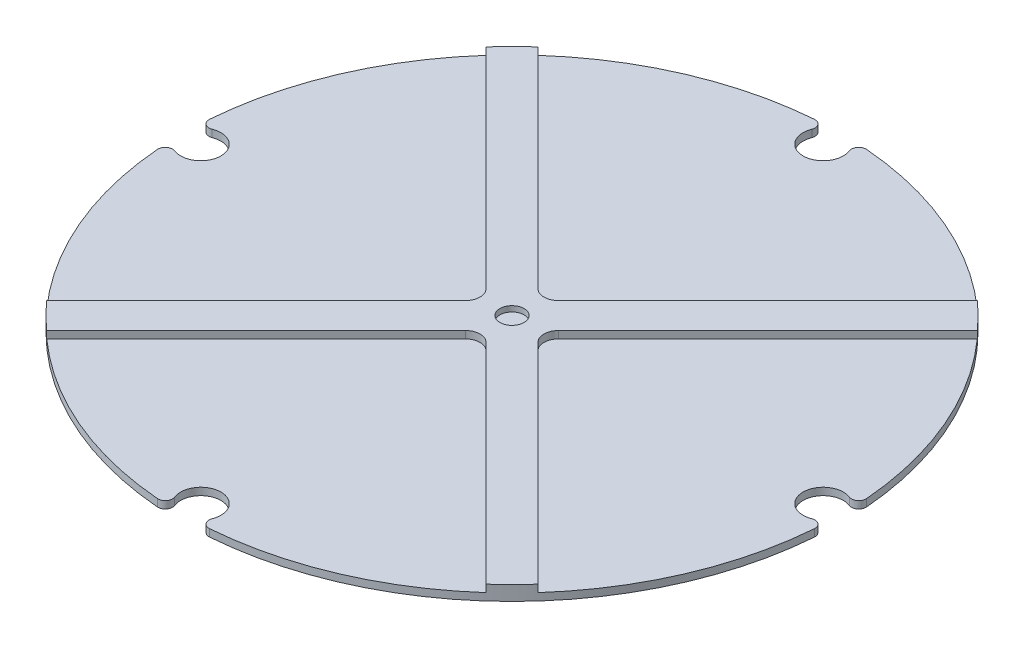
ISO-10303-21;
HEADER;
FILE_DESCRIPTION(('STEP AP214'),'2;1');
FILE_NAME('part.step','',(''),(''),'','','');
FILE_SCHEMA(('AUTOMOTIVE_DESIGN { 1 0 10303 214 1 1 1 1 }'));
ENDSEC;
DATA;
#1=APPLICATION_CONTEXT('core data for automotive mechanical design processes');
#2=APPLICATION_PROTOCOL_DEFINITION('international standard','automotive_design',2000,#1);
#3=PRODUCT_CONTEXT('',#1,'mechanical');
#4=PRODUCT('Part','Part','',(#3));
#5=PRODUCT_RELATED_PRODUCT_CATEGORY('part','',(#4));
#6=PRODUCT_DEFINITION_FORMATION('','',#4);
#7=PRODUCT_DEFINITION_CONTEXT('part definition',#1,'design');
#8=PRODUCT_DEFINITION('design','',#6,#7);
#9=PRODUCT_DEFINITION_SHAPE('','',#8);
#10=(LENGTH_UNIT() NAMED_UNIT(*) SI_UNIT(.MILLI.,.METRE.));
#11=(NAMED_UNIT(*) PLANE_ANGLE_UNIT() SI_UNIT($,.RADIAN.));
#12=(NAMED_UNIT(*) SI_UNIT($,.STERADIAN.) SOLID_ANGLE_UNIT());
#13=UNCERTAINTY_MEASURE_WITH_UNIT(LENGTH_MEASURE(1.E-05),#10,'distance_accuracy_value','');
#14=(GEOMETRIC_REPRESENTATION_CONTEXT(3) GLOBAL_UNCERTAINTY_ASSIGNED_CONTEXT((#13)) GLOBAL_UNIT_ASSIGNED_CONTEXT((#10,
#11,#12)) REPRESENTATION_CONTEXT('',''));
#15=CARTESIAN_POINT('',(0.,0.,0.));
#16=DIRECTION('',(0.,0.,1.));
#17=DIRECTION('',(1.,0.,0.));
#18=AXIS2_PLACEMENT_3D('',#15,#16,#17);
#19=CARTESIAN_POINT('',(0.,1.,0.));
#20=DIRECTION('',(0.,1.,0.));
#21=DIRECTION('',(0.,0.,1.));
#22=AXIS2_PLACEMENT_3D('',#19,#20,#21);
#23=PLANE('',#22);
#24=DIRECTION('',(0.707106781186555,0.,-0.70710678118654));
#25=VECTOR('',#24,1.);
#26=CARTESIAN_POINT('',(33.5384295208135,1.,-30.0028956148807));
#27=LINE('',#26,#25);
#28=CARTESIAN_POINT('',(4.94974746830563,1.,-1.4142135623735));
#29=VERTEX_POINT('',#28);
#30=CARTESIAN_POINT('',(33.5384295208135,1.,-30.0028956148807));
#31=VERTEX_POINT('',#30);
#32=EDGE_CURVE('E47',#29,#31,#27,.T.);
#33=ORIENTED_EDGE('',*,*,#32,.F.);
#34=CARTESIAN_POINT('',(6.3639610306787,1.,-3.7610192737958E-13));
#35=DIRECTION('',(0.,-1.,0.));
#36=DIRECTION('',(0.,0.,-1.));
#37=AXIS2_PLACEMENT_3D('',#34,#35,#36);
#38=CIRCLE('',#37,2.);
#39=CARTESIAN_POINT('',(4.94974746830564,1.,1.41421356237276));
#40=VERTEX_POINT('',#39);
#41=EDGE_CURVE('E51',#40,#29,#38,.T.);
#42=ORIENTED_EDGE('',*,*,#41,.F.);
#43=DIRECTION('',(-0.707106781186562,0.,-0.707106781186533));
#44=VECTOR('',#43,1.);
#45=CARTESIAN_POINT('',(4.94974746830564,1.,1.41421356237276));
#46=LINE('',#45,#44);
#47=CARTESIAN_POINT('',(33.5384295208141,1.,30.00289561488));
#48=VERTEX_POINT('',#47);
#49=EDGE_CURVE('E494',#48,#40,#46,.T.);
#50=ORIENTED_EDGE('',*,*,#49,.F.);
#51=CARTESIAN_POINT('',(0.,1.,0.));
#52=DIRECTION('',(0.,1.,0.));
#53=DIRECTION('',(0.,0.,1.));
#54=AXIS2_PLACEMENT_3D('',#51,#52,#53);
#55=CIRCLE('',#54,45.);
#56=CARTESIAN_POINT('',(44.8578709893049,1.,3.57371099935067));
#57=VERTEX_POINT('',#56);
#58=EDGE_CURVE('E288',#48,#57,#55,.T.);
#59=ORIENTED_EDGE('',*,*,#58,.T.);
#60=CARTESIAN_POINT('',(43.8610294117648,1.,3.49429519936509));
#61=DIRECTION('',(0.,1.,0.));
#62=DIRECTION('',(0.,0.,1.));
#63=AXIS2_PLACEMENT_3D('',#60,#61,#62);
#64=CIRCLE('',#63,1.);
#65=CARTESIAN_POINT('',(43.4980882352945,1.,2.56248314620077));
#66=VERTEX_POINT('',#65);
#67=EDGE_CURVE('E338',#57,#66,#64,.T.);
#68=ORIENTED_EDGE('',*,*,#67,.T.);
#69=CARTESIAN_POINT('',(42.5000000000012,1.,-1.20271790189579E-12));
#70=DIRECTION('',(0.,1.,0.));
#71=DIRECTION('',(0.,0.,1.));
#72=AXIS2_PLACEMENT_3D('',#69,#70,#71);
#73=CIRCLE('',#72,2.75);
#74=CARTESIAN_POINT('',(43.4980882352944,1.,-2.56248314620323));
#75=VERTEX_POINT('',#74);
#76=EDGE_CURVE('E273',#75,#66,#73,.T.);
#77=ORIENTED_EDGE('',*,*,#76,.F.);
#78=CARTESIAN_POINT('',(43.8610294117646,1.,-3.49429519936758));
#79=DIRECTION('',(0.,1.,0.));
#80=DIRECTION('',(0.,0.,1.));
#81=AXIS2_PLACEMENT_3D('',#78,#79,#80);
#82=CIRCLE('',#81,1.);
#83=CARTESIAN_POINT('',(44.8578709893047,1.,-3.5737109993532));
#84=VERTEX_POINT('',#83);
#85=EDGE_CURVE('E336',#75,#84,#82,.T.);
#86=ORIENTED_EDGE('',*,*,#85,.T.);
#87=EDGE_CURVE('E516',#84,#31,#55,.T.);
#88=ORIENTED_EDGE('',*,*,#87,.T.);
#89=EDGE_LOOP('',(#33,#42,#50,#59,#68,#77,#86,#88));
#90=FACE_BOUND('',#89,.T.);
#91=ADVANCED_FACE('F32',(#90),#23,.T.);
#92=DIRECTION('',(0.70710678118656,0.,0.707106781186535));
#93=VECTOR('',#92,1.);
#94=CARTESIAN_POINT('',(1.41421356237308,1.,4.94974746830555));
#95=LINE('',#94,#93);
#96=CARTESIAN_POINT('',(1.41421356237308,1.,4.94974746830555));
#97=VERTEX_POINT('',#96);
#98=CARTESIAN_POINT('',(30.0028956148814,1.,33.5384295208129));
#99=VERTEX_POINT('',#98);
#100=EDGE_CURVE('E492',#97,#99,#95,.T.);
#101=ORIENTED_EDGE('',*,*,#100,.F.);
#102=CARTESIAN_POINT('',(0.,1.,6.36396103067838));
#103=DIRECTION('',(0.,-1.,0.));
#104=DIRECTION('',(0.,0.,1.));
#105=AXIS2_PLACEMENT_3D('',#102,#103,#104);
#106=CIRCLE('',#105,1.9999999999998);
#107=CARTESIAN_POINT('',(-1.41421356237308,1.,4.94974746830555));
#108=VERTEX_POINT('',#107);
#109=EDGE_CURVE('E489',#108,#97,#106,.T.);
#110=ORIENTED_EDGE('',*,*,#109,.F.);
#111=DIRECTION('',(0.707106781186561,0.,-0.707106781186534));
#112=VECTOR('',#111,1.);
#113=CARTESIAN_POINT('',(-1.41421356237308,1.,4.94974746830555));
#114=LINE('',#113,#112);
#115=CARTESIAN_POINT('',(-30.0028956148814,1.,33.5384295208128));
#116=VERTEX_POINT('',#115);
#117=EDGE_CURVE('E486',#116,#108,#114,.T.);
#118=ORIENTED_EDGE('',*,*,#117,.F.);
#119=CARTESIAN_POINT('',(-3.57371099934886,1.,44.857870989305));
#120=VERTEX_POINT('',#119);
#121=EDGE_CURVE('E287',#116,#120,#55,.T.);
#122=ORIENTED_EDGE('',*,*,#121,.T.);
#123=CARTESIAN_POINT('',(-3.49429519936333,1.,43.8610294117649));
#124=DIRECTION('',(0.,1.,0.));
#125=DIRECTION('',(0.,0.,1.));
#126=AXIS2_PLACEMENT_3D('',#123,#124,#125);
#127=CIRCLE('',#126,1.);
#128=CARTESIAN_POINT('',(-2.56248314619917,1.,43.4980882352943));
#129=VERTEX_POINT('',#128);
#130=EDGE_CURVE('E342',#120,#129,#127,.T.);
#131=ORIENTED_EDGE('',*,*,#130,.T.);
#132=CARTESIAN_POINT('',(2.40543580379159E-12,1.,42.5));
#133=DIRECTION('',(0.,1.,0.));
#134=DIRECTION('',(0.,0.,1.));
#135=AXIS2_PLACEMENT_3D('',#132,#133,#134);
#136=CIRCLE('',#135,2.75);
#137=CARTESIAN_POINT('',(2.5624831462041,1.,43.498088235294));
#138=VERTEX_POINT('',#137);
#139=EDGE_CURVE('E267',#138,#129,#136,.T.);
#140=ORIENTED_EDGE('',*,*,#139,.F.);
#141=CARTESIAN_POINT('',(3.49429519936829,1.,43.8610294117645));
#142=DIRECTION('',(0.,1.,0.));
#143=DIRECTION('',(0.,0.,1.));
#144=AXIS2_PLACEMENT_3D('',#141,#142,#143);
#145=CIRCLE('',#144,1.);
#146=CARTESIAN_POINT('',(3.57371099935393,1.,44.8578709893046));
#147=VERTEX_POINT('',#146);
#148=EDGE_CURVE('E340',#138,#147,#145,.T.);
#149=ORIENTED_EDGE('',*,*,#148,.T.);
#150=EDGE_CURVE('E285',#147,#99,#55,.T.);
#151=ORIENTED_EDGE('',*,*,#150,.T.);
#152=EDGE_LOOP('',(#101,#110,#118,#122,#131,#140,#149,#151));
#153=FACE_BOUND('',#152,.T.);
#154=ADVANCED_FACE('F404',(#153),#23,.T.);
#155=DIRECTION('',(-0.707106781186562,0.,0.707106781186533));
#156=VECTOR('',#155,1.);
#157=CARTESIAN_POINT('',(-4.94974746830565,1.,1.41421356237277));
#158=LINE('',#157,#156);
#159=CARTESIAN_POINT('',(-4.94974746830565,1.,1.41421356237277));
#160=VERTEX_POINT('',#159);
#161=CARTESIAN_POINT('',(-33.5384295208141,1.,30.00289561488));
#162=VERTEX_POINT('',#161);
#163=EDGE_CURVE('E483',#160,#162,#158,.T.);
#164=ORIENTED_EDGE('',*,*,#163,.F.);
#165=CARTESIAN_POINT('',(-6.3639610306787,1.,-3.68316488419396E-13));
#166=DIRECTION('',(0.,-1.,0.));
#167=DIRECTION('',(0.,0.,-1.));
#168=AXIS2_PLACEMENT_3D('',#165,#166,#167);
#169=CIRCLE('',#168,1.99999999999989);
#170=CARTESIAN_POINT('',(-4.94974746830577,1.,-1.41421356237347));
#171=VERTEX_POINT('',#170);
#172=EDGE_CURVE('E480',#171,#160,#169,.T.);
#173=ORIENTED_EDGE('',*,*,#172,.F.);
#174=DIRECTION('',(0.707106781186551,0.,0.707106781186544));
#175=VECTOR('',#174,1.);
#176=CARTESIAN_POINT('',(-33.5384295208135,1.,-30.0028956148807));
#177=LINE('',#176,#175);
#178=CARTESIAN_POINT('',(-33.5384295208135,1.,-30.0028956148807));
#179=VERTEX_POINT('',#178);
#180=EDGE_CURVE('E472',#179,#171,#177,.T.);
#181=ORIENTED_EDGE('',*,*,#180,.F.);
#182=CARTESIAN_POINT('',(-44.857870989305,1.,-3.57371099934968));
#183=VERTEX_POINT('',#182);
#184=EDGE_CURVE('E289',#179,#183,#55,.T.);
#185=ORIENTED_EDGE('',*,*,#184,.T.);
#186=CARTESIAN_POINT('',(-43.8610294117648,1.,-3.49429519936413));
#187=DIRECTION('',(0.,1.,0.));
#188=DIRECTION('',(0.,0.,1.));
#189=AXIS2_PLACEMENT_3D('',#186,#187,#188);
#190=CIRCLE('',#189,1.);
#191=CARTESIAN_POINT('',(-43.4980882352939,1.,-2.56248314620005));
#192=VERTEX_POINT('',#191);
#193=EDGE_CURVE('E344',#183,#192,#190,.T.);
#194=ORIENTED_EDGE('',*,*,#193,.T.);
#195=CARTESIAN_POINT('',(-42.4999999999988,1.,1.20792265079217E-12));
#196=DIRECTION('',(0.,1.,0.));
#197=DIRECTION('',(0.,0.,1.));
#198=AXIS2_PLACEMENT_3D('',#195,#196,#197);
#199=CIRCLE('',#198,2.75);
#200=CARTESIAN_POINT('',(-43.4980882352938,1.,2.56248314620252));
#201=VERTEX_POINT('',#200);
#202=EDGE_CURVE('E264',#201,#192,#199,.T.);
#203=ORIENTED_EDGE('',*,*,#202,.F.);
#204=CARTESIAN_POINT('',(-43.8610294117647,1.,3.49429519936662));
#205=DIRECTION('',(0.,1.,0.));
#206=DIRECTION('',(0.,0.,1.));
#207=AXIS2_PLACEMENT_3D('',#204,#205,#206);
#208=CIRCLE('',#207,1.);
#209=CARTESIAN_POINT('',(-44.8578709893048,1.,3.57371099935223));
#210=VERTEX_POINT('',#209);
#211=EDGE_CURVE('E346',#201,#210,#208,.T.);
#212=ORIENTED_EDGE('',*,*,#211,.T.);
#213=EDGE_CURVE('E290',#210,#162,#55,.T.);
#214=ORIENTED_EDGE('',*,*,#213,.T.);
#215=EDGE_LOOP('',(#164,#173,#181,#185,#194,#203,#212,#214));
#216=FACE_BOUND('',#215,.T.);
#217=ADVANCED_FACE('F520',(#216),#23,.T.);
#218=CARTESIAN_POINT('',(0.,1.,0.));
#219=DIRECTION('',(0.,-1.,0.));
#220=DIRECTION('',(0.,0.,-1.));
#221=AXIS2_PLACEMENT_3D('',#218,#219,#220);
#222=CYLINDRICAL_SURFACE('',#221,45.);
#223=ORIENTED_EDGE('',*,*,#150,.F.);
#224=DIRECTION('',(0.,-1.,0.));
#225=VECTOR('',#224,1.);
#226=CARTESIAN_POINT('',(3.57371099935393,1.,44.8578709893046));
#227=LINE('',#226,#225);
#228=CARTESIAN_POINT('',(3.57371099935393,0.,44.8578709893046));
#229=VERTEX_POINT('',#228);
#230=EDGE_CURVE('E361',#147,#229,#227,.T.);
#231=ORIENTED_EDGE('',*,*,#230,.T.);
#232=CARTESIAN_POINT('',(0.,0.,0.));
#233=DIRECTION('',(0.,1.,0.));
#234=DIRECTION('',(0.,0.,1.));
#235=AXIS2_PLACEMENT_3D('',#232,#233,#234);
#236=CIRCLE('',#235,45.);
#237=CARTESIAN_POINT('',(44.8578709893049,0.,3.57371099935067));
#238=VERTEX_POINT('',#237);
#239=EDGE_CURVE('E295',#229,#238,#236,.T.);
#240=ORIENTED_EDGE('',*,*,#239,.T.);
#241=DIRECTION('',(0.,-1.,0.));
#242=VECTOR('',#241,1.);
#243=CARTESIAN_POINT('',(44.8578709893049,1.,3.57371099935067));
#244=LINE('',#243,#242);
#245=EDGE_CURVE('E358',#238,#57,#244,.F.);
#246=ORIENTED_EDGE('',*,*,#245,.T.);
#247=ORIENTED_EDGE('',*,*,#58,.F.);
#248=DIRECTION('',(0.,-1.,0.));
#249=VECTOR('',#248,1.);
#250=CARTESIAN_POINT('',(33.5384295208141,2.,30.00289561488));
#251=LINE('',#250,#249);
#252=CARTESIAN_POINT('',(33.5384295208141,2.,30.00289561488));
#253=VERTEX_POINT('',#252);
#254=EDGE_CURVE('E427',#253,#48,#251,.T.);
#255=ORIENTED_EDGE('',*,*,#254,.F.);
#256=CARTESIAN_POINT('',(0.,2.,0.));
#257=DIRECTION('',(0.,1.,0.));
#258=DIRECTION('',(0.,0.,1.));
#259=AXIS2_PLACEMENT_3D('',#256,#257,#258);
#260=CIRCLE('',#259,45.);
#261=CARTESIAN_POINT('',(30.0028956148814,2.,33.5384295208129));
#262=VERTEX_POINT('',#261);
#263=EDGE_CURVE('E423',#262,#253,#260,.T.);
#264=ORIENTED_EDGE('',*,*,#263,.F.);
#265=DIRECTION('',(0.,-1.,0.));
#266=VECTOR('',#265,1.);
#267=CARTESIAN_POINT('',(30.0028956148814,2.,33.5384295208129));
#268=LINE('',#267,#266);
#269=EDGE_CURVE('E421',#262,#99,#268,.T.);
#270=ORIENTED_EDGE('',*,*,#269,.T.);
#271=EDGE_LOOP('',(#223,#231,#240,#246,#247,#255,#264,#270));
#272=FACE_BOUND('',#271,.T.);
#273=ADVANCED_FACE('F417',(#272),#222,.T.);
#274=ORIENTED_EDGE('',*,*,#213,.F.);
#275=DIRECTION('',(0.,-1.,0.));
#276=VECTOR('',#275,1.);
#277=CARTESIAN_POINT('',(-44.8578709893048,1.,3.57371099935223));
#278=LINE('',#277,#276);
#279=CARTESIAN_POINT('',(-44.8578709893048,0.,3.57371099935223));
#280=VERTEX_POINT('',#279);
#281=EDGE_CURVE('E309',#210,#280,#278,.T.);
#282=ORIENTED_EDGE('',*,*,#281,.T.);
#283=CARTESIAN_POINT('',(-3.57371099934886,0.,44.857870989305));
#284=VERTEX_POINT('',#283);
#285=EDGE_CURVE('E294',#280,#284,#236,.T.);
#286=ORIENTED_EDGE('',*,*,#285,.T.);
#287=DIRECTION('',(0.,-1.,0.));
#288=VECTOR('',#287,1.);
#289=CARTESIAN_POINT('',(-3.57371099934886,1.,44.857870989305));
#290=LINE('',#289,#288);
#291=EDGE_CURVE('E306',#284,#120,#290,.F.);
#292=ORIENTED_EDGE('',*,*,#291,.T.);
#293=ORIENTED_EDGE('',*,*,#121,.F.);
#294=DIRECTION('',(0.,-1.,0.));
#295=VECTOR('',#294,1.);
#296=CARTESIAN_POINT('',(-30.0028956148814,2.,33.5384295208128));
#297=LINE('',#296,#295);
#298=CARTESIAN_POINT('',(-30.0028956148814,2.,33.5384295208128));
#299=VERTEX_POINT('',#298);
#300=EDGE_CURVE('E439',#299,#116,#297,.T.);
#301=ORIENTED_EDGE('',*,*,#300,.F.);
#302=CARTESIAN_POINT('',(0.,2.,0.));
#303=DIRECTION('',(0.,1.,0.));
#304=DIRECTION('',(0.,0.,1.));
#305=AXIS2_PLACEMENT_3D('',#302,#303,#304);
#306=CIRCLE('',#305,45.);
#307=CARTESIAN_POINT('',(-33.5384295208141,2.,30.00289561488));
#308=VERTEX_POINT('',#307);
#309=EDGE_CURVE('E530',#308,#299,#306,.T.);
#310=ORIENTED_EDGE('',*,*,#309,.F.);
#311=DIRECTION('',(0.,-1.,0.));
#312=VECTOR('',#311,1.);
#313=CARTESIAN_POINT('',(-33.5384295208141,2.,30.00289561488));
#314=LINE('',#313,#312);
#315=EDGE_CURVE('E442',#308,#162,#314,.T.);
#316=ORIENTED_EDGE('',*,*,#315,.T.);
#317=EDGE_LOOP('',(#274,#282,#286,#292,#293,#301,#310,#316));
#318=FACE_BOUND('',#317,.T.);
#319=ADVANCED_FACE('F394',(#318),#222,.T.);
#320=CARTESIAN_POINT('',(-3.5737109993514,0.,-44.8578709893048));
#321=VERTEX_POINT('',#320);
#322=CARTESIAN_POINT('',(-44.857870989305,0.,-3.57371099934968));
#323=VERTEX_POINT('',#322);
#324=EDGE_CURVE('E291',#321,#323,#236,.T.);
#325=ORIENTED_EDGE('',*,*,#324,.T.);
#326=DIRECTION('',(0.,-1.,0.));
#327=VECTOR('',#326,1.);
#328=CARTESIAN_POINT('',(-44.857870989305,1.,-3.57371099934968));
#329=LINE('',#328,#327);
#330=EDGE_CURVE('E351',#323,#183,#329,.F.);
#331=ORIENTED_EDGE('',*,*,#330,.T.);
#332=ORIENTED_EDGE('',*,*,#184,.F.);
#333=DIRECTION('',(0.,-1.,0.));
#334=VECTOR('',#333,1.);
#335=CARTESIAN_POINT('',(-33.5384295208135,2.,-30.0028956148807));
#336=LINE('',#335,#334);
#337=CARTESIAN_POINT('',(-33.5384295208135,2.,-30.0028956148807));
#338=VERTEX_POINT('',#337);
#339=EDGE_CURVE('E451',#338,#179,#336,.T.);
#340=ORIENTED_EDGE('',*,*,#339,.F.);
#341=CARTESIAN_POINT('',(0.,2.,0.));
#342=DIRECTION('',(0.,1.,0.));
#343=DIRECTION('',(0.,0.,1.));
#344=AXIS2_PLACEMENT_3D('',#341,#342,#343);
#345=CIRCLE('',#344,45.);
#346=CARTESIAN_POINT('',(-30.0028956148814,2.,-33.5384295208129));
#347=VERTEX_POINT('',#346);
#348=EDGE_CURVE('E886',#347,#338,#345,.T.);
#349=ORIENTED_EDGE('',*,*,#348,.F.);
#350=DIRECTION('',(0.,-1.,0.));
#351=VECTOR('',#350,1.);
#352=CARTESIAN_POINT('',(-30.0028956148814,2.,-33.5384295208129));
#353=LINE('',#352,#351);
#354=CARTESIAN_POINT('',(-30.0028956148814,1.,-33.5384295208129));
#355=VERTEX_POINT('',#354);
#356=EDGE_CURVE('E454',#347,#355,#353,.T.);
#357=ORIENTED_EDGE('',*,*,#356,.T.);
#358=CARTESIAN_POINT('',(-3.5737109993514,1.,-44.8578709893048));
#359=VERTEX_POINT('',#358);
#360=EDGE_CURVE('E300',#359,#355,#55,.T.);
#361=ORIENTED_EDGE('',*,*,#360,.F.);
#362=DIRECTION('',(0.,-1.,0.));
#363=VECTOR('',#362,1.);
#364=CARTESIAN_POINT('',(-3.5737109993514,1.,-44.8578709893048));
#365=LINE('',#364,#363);
#366=EDGE_CURVE('E348',#359,#321,#365,.T.);
#367=ORIENTED_EDGE('',*,*,#366,.T.);
#368=EDGE_LOOP('',(#325,#331,#332,#340,#349,#357,#361,#367));
#369=FACE_BOUND('',#368,.T.);
#370=ADVANCED_FACE('F582',(#369),#222,.T.);
#371=ORIENTED_EDGE('',*,*,#87,.F.);
#372=DIRECTION('',(0.,-1.,0.));
#373=VECTOR('',#372,1.);
#374=CARTESIAN_POINT('',(44.8578709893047,1.,-3.5737109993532));
#375=LINE('',#374,#373);
#376=CARTESIAN_POINT('',(44.8578709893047,0.,-3.5737109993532));
#377=VERTEX_POINT('',#376);
#378=EDGE_CURVE('E370',#84,#377,#375,.T.);
#379=ORIENTED_EDGE('',*,*,#378,.T.);
#380=CARTESIAN_POINT('',(3.5737109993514,0.,-44.8578709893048));
#381=VERTEX_POINT('',#380);
#382=EDGE_CURVE('E284',#377,#381,#236,.T.);
#383=ORIENTED_EDGE('',*,*,#382,.T.);
#384=DIRECTION('',(0.,-1.,0.));
#385=VECTOR('',#384,1.);
#386=CARTESIAN_POINT('',(3.5737109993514,1.,-44.8578709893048));
#387=LINE('',#386,#385);
#388=CARTESIAN_POINT('',(3.5737109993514,1.,-44.8578709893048));
#389=VERTEX_POINT('',#388);
#390=EDGE_CURVE('E368',#381,#389,#387,.F.);
#391=ORIENTED_EDGE('',*,*,#390,.T.);
#392=CARTESIAN_POINT('',(30.0028956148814,1.,-33.5384295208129));
#393=VERTEX_POINT('',#392);
#394=EDGE_CURVE('E263',#393,#389,#55,.T.);
#395=ORIENTED_EDGE('',*,*,#394,.F.);
#396=DIRECTION('',(0.,-1.,0.));
#397=VECTOR('',#396,1.);
#398=CARTESIAN_POINT('',(30.0028956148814,2.,-33.5384295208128));
#399=LINE('',#398,#397);
#400=CARTESIAN_POINT('',(30.0028956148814,2.,-33.5384295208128));
#401=VERTEX_POINT('',#400);
#402=EDGE_CURVE('E243',#401,#393,#399,.T.);
#403=ORIENTED_EDGE('',*,*,#402,.F.);
#404=CARTESIAN_POINT('',(0.,2.,0.));
#405=DIRECTION('',(0.,1.,0.));
#406=DIRECTION('',(0.,0.,1.));
#407=AXIS2_PLACEMENT_3D('',#404,#405,#406);
#408=CIRCLE('',#407,45.);
#409=CARTESIAN_POINT('',(33.5384295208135,2.,-30.0028956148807));
#410=VERTEX_POINT('',#409);
#411=EDGE_CURVE('E249',#410,#401,#408,.T.);
#412=ORIENTED_EDGE('',*,*,#411,.F.);
#413=DIRECTION('',(0.,-1.,0.));
#414=VECTOR('',#413,1.);
#415=CARTESIAN_POINT('',(33.5384295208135,2.,-30.0028956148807));
#416=LINE('',#415,#414);
#417=EDGE_CURVE('E498',#410,#31,#416,.T.);
#418=ORIENTED_EDGE('',*,*,#417,.T.);
#419=EDGE_LOOP('',(#371,#379,#383,#391,#395,#403,#412,#418));
#420=FACE_BOUND('',#419,.T.);
#421=ADVANCED_FACE('F261',(#420),#222,.T.);
#422=DIRECTION('',(-0.707106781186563,0.,-0.707106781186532));
#423=VECTOR('',#422,1.);
#424=CARTESIAN_POINT('',(-30.0028956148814,1.,-33.5384295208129));
#425=LINE('',#424,#423);
#426=CARTESIAN_POINT('',(-1.41421356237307,1.,-4.9497474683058));
#427=VERTEX_POINT('',#426);
#428=EDGE_CURVE('E463',#427,#355,#425,.T.);
#429=ORIENTED_EDGE('',*,*,#428,.F.);
#430=CARTESIAN_POINT('',(0.,1.,-6.36396103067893));
#431=DIRECTION('',(0.,-1.,0.));
#432=DIRECTION('',(0.,0.,1.));
#433=AXIS2_PLACEMENT_3D('',#430,#431,#432);
#434=CIRCLE('',#433,2.0000000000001);
#435=CARTESIAN_POINT('',(1.41421356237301,1.,-4.94974746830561));
#436=VERTEX_POINT('',#435);
#437=EDGE_CURVE('E468',#436,#427,#434,.T.);
#438=ORIENTED_EDGE('',*,*,#437,.F.);
#439=DIRECTION('',(-0.70710678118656,0.,0.707106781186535));
#440=VECTOR('',#439,1.);
#441=CARTESIAN_POINT('',(30.0028956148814,1.,-33.5384295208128));
#442=LINE('',#441,#440);
#443=EDGE_CURVE('E470',#393,#436,#442,.T.);
#444=ORIENTED_EDGE('',*,*,#443,.F.);
#445=ORIENTED_EDGE('',*,*,#394,.T.);
#446=CARTESIAN_POINT('',(3.49429519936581,1.,-43.8610294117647));
#447=DIRECTION('',(0.,1.,0.));
#448=DIRECTION('',(0.,0.,1.));
#449=AXIS2_PLACEMENT_3D('',#446,#447,#448);
#450=CIRCLE('',#449,1.);
#451=CARTESIAN_POINT('',(2.56248314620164,1.,-43.4980882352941));
#452=VERTEX_POINT('',#451);
#453=EDGE_CURVE('E332',#389,#452,#450,.T.);
#454=ORIENTED_EDGE('',*,*,#453,.T.);
#455=CARTESIAN_POINT('',(0.,1.,-42.5));
#456=DIRECTION('',(0.,1.,0.));
#457=DIRECTION('',(0.,0.,1.));
#458=AXIS2_PLACEMENT_3D('',#455,#456,#457);
#459=CIRCLE('',#458,2.75);
#460=CARTESIAN_POINT('',(-2.56248314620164,1.,-43.4980882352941));
#461=VERTEX_POINT('',#460);
#462=EDGE_CURVE('E276',#461,#452,#459,.T.);
#463=ORIENTED_EDGE('',*,*,#462,.F.);
#464=CARTESIAN_POINT('',(-3.49429519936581,1.,-43.8610294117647));
#465=DIRECTION('',(0.,1.,0.));
#466=DIRECTION('',(0.,0.,1.));
#467=AXIS2_PLACEMENT_3D('',#464,#465,#466);
#468=CIRCLE('',#467,1.);
#469=EDGE_CURVE('E334',#461,#359,#468,.T.);
#470=ORIENTED_EDGE('',*,*,#469,.T.);
#471=ORIENTED_EDGE('',*,*,#360,.T.);
#472=EDGE_LOOP('',(#429,#438,#444,#445,#454,#463,#470,#471));
#473=FACE_BOUND('',#472,.T.);
#474=ADVANCED_FACE('F571',(#473),#23,.T.);
#475=CARTESIAN_POINT('',(0.,0.,0.));
#476=DIRECTION('',(0.,1.,0.));
#477=DIRECTION('',(0.,0.,1.));
#478=AXIS2_PLACEMENT_3D('',#475,#476,#477);
#479=PLANE('',#478);
#480=ORIENTED_EDGE('',*,*,#285,.F.);
#481=CARTESIAN_POINT('',(-43.8610294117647,0.,3.49429519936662));
#482=DIRECTION('',(0.,1.,0.));
#483=DIRECTION('',(0.,0.,1.));
#484=AXIS2_PLACEMENT_3D('',#481,#482,#483);
#485=CIRCLE('',#484,1.);
#486=CARTESIAN_POINT('',(-43.4980882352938,0.,2.56248314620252));
#487=VERTEX_POINT('',#486);
#488=EDGE_CURVE('E326',#280,#487,#485,.F.);
#489=ORIENTED_EDGE('',*,*,#488,.T.);
#490=CARTESIAN_POINT('',(-42.4999999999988,0.,1.20792265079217E-12));
#491=DIRECTION('',(0.,1.,0.));
#492=DIRECTION('',(0.,0.,1.));
#493=AXIS2_PLACEMENT_3D('',#490,#491,#492);
#494=CIRCLE('',#493,2.75);
#495=CARTESIAN_POINT('',(-43.4980882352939,0.,-2.56248314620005));
#496=VERTEX_POINT('',#495);
#497=EDGE_CURVE('E299',#487,#496,#494,.T.);
#498=ORIENTED_EDGE('',*,*,#497,.T.);
#499=CARTESIAN_POINT('',(-43.8610294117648,0.,-3.49429519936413));
#500=DIRECTION('',(0.,1.,0.));
#501=DIRECTION('',(0.,0.,1.));
#502=AXIS2_PLACEMENT_3D('',#499,#500,#501);
#503=CIRCLE('',#502,1.);
#504=EDGE_CURVE('E324',#496,#323,#503,.F.);
#505=ORIENTED_EDGE('',*,*,#504,.T.);
#506=ORIENTED_EDGE('',*,*,#324,.F.);
#507=CARTESIAN_POINT('',(-3.49429519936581,0.,-43.8610294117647));
#508=DIRECTION('',(0.,1.,0.));
#509=DIRECTION('',(0.,0.,1.));
#510=AXIS2_PLACEMENT_3D('',#507,#508,#509);
#511=CIRCLE('',#510,1.);
#512=CARTESIAN_POINT('',(-2.56248314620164,0.,-43.4980882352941));
#513=VERTEX_POINT('',#512);
#514=EDGE_CURVE('E314',#321,#513,#511,.F.);
#515=ORIENTED_EDGE('',*,*,#514,.T.);
#516=CARTESIAN_POINT('',(0.,0.,-42.5));
#517=DIRECTION('',(0.,1.,0.));
#518=DIRECTION('',(0.,0.,1.));
#519=AXIS2_PLACEMENT_3D('',#516,#517,#518);
#520=CIRCLE('',#519,2.75);
#521=CARTESIAN_POINT('',(2.56248314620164,0.,-43.4980882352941));
#522=VERTEX_POINT('',#521);
#523=EDGE_CURVE('E296',#513,#522,#520,.T.);
#524=ORIENTED_EDGE('',*,*,#523,.T.);
#525=CARTESIAN_POINT('',(3.49429519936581,0.,-43.8610294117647));
#526=DIRECTION('',(0.,1.,0.));
#527=DIRECTION('',(0.,0.,1.));
#528=AXIS2_PLACEMENT_3D('',#525,#526,#527);
#529=CIRCLE('',#528,1.);
#530=EDGE_CURVE('E312',#522,#381,#529,.F.);
#531=ORIENTED_EDGE('',*,*,#530,.T.);
#532=ORIENTED_EDGE('',*,*,#382,.F.);
#533=CARTESIAN_POINT('',(43.8610294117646,0.,-3.49429519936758));
#534=DIRECTION('',(0.,1.,0.));
#535=DIRECTION('',(0.,0.,1.));
#536=AXIS2_PLACEMENT_3D('',#533,#534,#535);
#537=CIRCLE('',#536,1.);
#538=CARTESIAN_POINT('',(43.4980882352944,0.,-2.56248314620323));
#539=VERTEX_POINT('',#538);
#540=EDGE_CURVE('E316',#377,#539,#537,.F.);
#541=ORIENTED_EDGE('',*,*,#540,.T.);
#542=CARTESIAN_POINT('',(42.5000000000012,0.,-1.20271790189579E-12));
#543=DIRECTION('',(0.,1.,0.));
#544=DIRECTION('',(0.,0.,1.));
#545=AXIS2_PLACEMENT_3D('',#542,#543,#544);
#546=CIRCLE('',#545,2.75);
#547=CARTESIAN_POINT('',(43.4980882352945,0.,2.56248314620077));
#548=VERTEX_POINT('',#547);
#549=EDGE_CURVE('E303',#539,#548,#546,.T.);
#550=ORIENTED_EDGE('',*,*,#549,.T.);
#551=CARTESIAN_POINT('',(43.8610294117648,0.,3.49429519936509));
#552=DIRECTION('',(0.,1.,0.));
#553=DIRECTION('',(0.,0.,1.));
#554=AXIS2_PLACEMENT_3D('',#551,#552,#553);
#555=CIRCLE('',#554,1.);
#556=EDGE_CURVE('E318',#548,#238,#555,.F.);
#557=ORIENTED_EDGE('',*,*,#556,.T.);
#558=ORIENTED_EDGE('',*,*,#239,.F.);
#559=CARTESIAN_POINT('',(3.49429519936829,0.,43.8610294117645));
#560=DIRECTION('',(0.,1.,0.));
#561=DIRECTION('',(0.,0.,1.));
#562=AXIS2_PLACEMENT_3D('',#559,#560,#561);
#563=CIRCLE('',#562,1.);
#564=CARTESIAN_POINT('',(2.5624831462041,0.,43.498088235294));
#565=VERTEX_POINT('',#564);
#566=EDGE_CURVE('E320',#229,#565,#563,.F.);
#567=ORIENTED_EDGE('',*,*,#566,.T.);
#568=CARTESIAN_POINT('',(2.40543580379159E-12,0.,42.5));
#569=DIRECTION('',(0.,1.,0.));
#570=DIRECTION('',(0.,0.,1.));
#571=AXIS2_PLACEMENT_3D('',#568,#569,#570);
#572=CIRCLE('',#571,2.75);
#573=CARTESIAN_POINT('',(-2.56248314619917,0.,43.4980882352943));
#574=VERTEX_POINT('',#573);
#575=EDGE_CURVE('E277',#565,#574,#572,.T.);
#576=ORIENTED_EDGE('',*,*,#575,.T.);
#577=CARTESIAN_POINT('',(-3.49429519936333,0.,43.8610294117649));
#578=DIRECTION('',(0.,1.,0.));
#579=DIRECTION('',(0.,0.,1.));
#580=AXIS2_PLACEMENT_3D('',#577,#578,#579);
#581=CIRCLE('',#580,1.);
#582=EDGE_CURVE('E322',#574,#284,#581,.F.);
#583=ORIENTED_EDGE('',*,*,#582,.T.);
#584=EDGE_LOOP('',(#480,#489,#498,#505,#506,#515,#524,#531,#532,#541,#550,#557,#558,#567,#576,#583));
#585=FACE_BOUND('',#584,.T.);
#586=ADVANCED_FACE('F383',(#585),#479,.F.);
#587=CARTESIAN_POINT('',(0.,0.,-42.5));
#588=DIRECTION('',(0.,1.,0.));
#589=DIRECTION('',(0.,0.,1.));
#590=AXIS2_PLACEMENT_3D('',#587,#588,#589);
#591=CYLINDRICAL_SURFACE('',#590,2.75);
#592=ORIENTED_EDGE('',*,*,#523,.F.);
#593=DIRECTION('',(0.,1.,0.));
#594=VECTOR('',#593,1.);
#595=CARTESIAN_POINT('',(-2.56248314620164,0.,-43.4980882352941));
#596=LINE('',#595,#594);
#597=EDGE_CURVE('E11',#513,#461,#596,.T.);
#598=ORIENTED_EDGE('',*,*,#597,.T.);
#599=ORIENTED_EDGE('',*,*,#462,.T.);
#600=DIRECTION('',(0.,1.,0.));
#601=VECTOR('',#600,1.);
#602=CARTESIAN_POINT('',(2.56248314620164,0.,-43.4980882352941));
#603=LINE('',#602,#601);
#604=EDGE_CURVE('E40',#452,#522,#603,.F.);
#605=ORIENTED_EDGE('',*,*,#604,.T.);
#606=EDGE_LOOP('',(#592,#598,#599,#605));
#607=FACE_BOUND('',#606,.T.);
#608=ADVANCED_FACE('F375',(#607),#591,.F.);
#609=CARTESIAN_POINT('',(-42.4999999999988,0.,1.20792265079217E-12));
#610=DIRECTION('',(0.,1.,0.));
#611=DIRECTION('',(0.,0.,1.));
#612=AXIS2_PLACEMENT_3D('',#609,#610,#611);
#613=CYLINDRICAL_SURFACE('',#612,2.75);
#614=ORIENTED_EDGE('',*,*,#497,.F.);
#615=DIRECTION('',(0.,1.,0.));
#616=VECTOR('',#615,1.);
#617=CARTESIAN_POINT('',(-43.4980882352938,0.,2.56248314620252));
#618=LINE('',#617,#616);
#619=EDGE_CURVE('E330',#487,#201,#618,.T.);
#620=ORIENTED_EDGE('',*,*,#619,.T.);
#621=ORIENTED_EDGE('',*,*,#202,.T.);
#622=DIRECTION('',(0.,1.,0.));
#623=VECTOR('',#622,1.);
#624=CARTESIAN_POINT('',(-43.4980882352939,0.,-2.56248314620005));
#625=LINE('',#624,#623);
#626=EDGE_CURVE('E328',#192,#496,#625,.F.);
#627=ORIENTED_EDGE('',*,*,#626,.T.);
#628=EDGE_LOOP('',(#614,#620,#621,#627));
#629=FACE_BOUND('',#628,.T.);
#630=ADVANCED_FACE('F825',(#629),#613,.F.);
#631=CARTESIAN_POINT('',(2.40543580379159E-12,0.,42.5));
#632=DIRECTION('',(0.,1.,0.));
#633=DIRECTION('',(0.,0.,1.));
#634=AXIS2_PLACEMENT_3D('',#631,#632,#633);
#635=CYLINDRICAL_SURFACE('',#634,2.75);
#636=ORIENTED_EDGE('',*,*,#139,.T.);
#637=DIRECTION('',(0.,1.,0.));
#638=VECTOR('',#637,1.);
#639=CARTESIAN_POINT('',(-2.56248314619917,0.,43.4980882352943));
#640=LINE('',#639,#638);
#641=EDGE_CURVE('E356',#129,#574,#640,.F.);
#642=ORIENTED_EDGE('',*,*,#641,.T.);
#643=ORIENTED_EDGE('',*,*,#575,.F.);
#644=DIRECTION('',(0.,1.,0.));
#645=VECTOR('',#644,1.);
#646=CARTESIAN_POINT('',(2.5624831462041,0.,43.498088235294));
#647=LINE('',#646,#645);
#648=EDGE_CURVE('E354',#565,#138,#647,.T.);
#649=ORIENTED_EDGE('',*,*,#648,.T.);
#650=EDGE_LOOP('',(#636,#642,#643,#649));
#651=FACE_BOUND('',#650,.T.);
#652=ADVANCED_FACE('F407',(#651),#635,.F.);
#653=CARTESIAN_POINT('',(42.5000000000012,0.,-1.20271790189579E-12));
#654=DIRECTION('',(0.,1.,0.));
#655=DIRECTION('',(0.,0.,1.));
#656=AXIS2_PLACEMENT_3D('',#653,#654,#655);
#657=CYLINDRICAL_SURFACE('',#656,2.75);
#658=ORIENTED_EDGE('',*,*,#76,.T.);
#659=DIRECTION('',(0.,1.,0.));
#660=VECTOR('',#659,1.);
#661=CARTESIAN_POINT('',(43.4980882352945,0.,2.56248314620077));
#662=LINE('',#661,#660);
#663=EDGE_CURVE('E366',#66,#548,#662,.F.);
#664=ORIENTED_EDGE('',*,*,#663,.T.);
#665=ORIENTED_EDGE('',*,*,#549,.F.);
#666=DIRECTION('',(0.,1.,0.));
#667=VECTOR('',#666,1.);
#668=CARTESIAN_POINT('',(43.4980882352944,0.,-2.56248314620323));
#669=LINE('',#668,#667);
#670=EDGE_CURVE('E364',#539,#75,#669,.T.);
#671=ORIENTED_EDGE('',*,*,#670,.T.);
#672=EDGE_LOOP('',(#658,#664,#665,#671));
#673=FACE_BOUND('',#672,.T.);
#674=ADVANCED_FACE('F555',(#673),#657,.F.);
#675=CARTESIAN_POINT('',(-43.8610294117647,0.,3.49429519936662));
#676=DIRECTION('',(0.,1.,0.));
#677=DIRECTION('',(0.,0.,1.));
#678=AXIS2_PLACEMENT_3D('',#675,#676,#677);
#679=CYLINDRICAL_SURFACE('',#678,1.);
#680=ORIENTED_EDGE('',*,*,#211,.F.);
#681=ORIENTED_EDGE('',*,*,#619,.F.);
#682=ORIENTED_EDGE('',*,*,#488,.F.);
#683=ORIENTED_EDGE('',*,*,#281,.F.);
#684=EDGE_LOOP('',(#680,#681,#682,#683));
#685=FACE_BOUND('',#684,.T.);
#686=ADVANCED_FACE('F592',(#685),#679,.T.);
#687=CARTESIAN_POINT('',(-43.8610294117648,0.,-3.49429519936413));
#688=DIRECTION('',(0.,-1.,0.));
#689=DIRECTION('',(0.,0.,-1.));
#690=AXIS2_PLACEMENT_3D('',#687,#688,#689);
#691=CYLINDRICAL_SURFACE('',#690,1.);
#692=ORIENTED_EDGE('',*,*,#504,.F.);
#693=ORIENTED_EDGE('',*,*,#626,.F.);
#694=ORIENTED_EDGE('',*,*,#193,.F.);
#695=ORIENTED_EDGE('',*,*,#330,.F.);
#696=EDGE_LOOP('',(#692,#693,#694,#695));
#697=FACE_BOUND('',#696,.T.);
#698=ADVANCED_FACE('F595',(#697),#691,.T.);
#699=CARTESIAN_POINT('',(-3.49429519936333,0.,43.8610294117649));
#700=DIRECTION('',(0.,-1.,0.));
#701=DIRECTION('',(0.,0.,-1.));
#702=AXIS2_PLACEMENT_3D('',#699,#700,#701);
#703=CYLINDRICAL_SURFACE('',#702,1.);
#704=ORIENTED_EDGE('',*,*,#582,.F.);
#705=ORIENTED_EDGE('',*,*,#641,.F.);
#706=ORIENTED_EDGE('',*,*,#130,.F.);
#707=ORIENTED_EDGE('',*,*,#291,.F.);
#708=EDGE_LOOP('',(#704,#705,#706,#707));
#709=FACE_BOUND('',#708,.T.);
#710=ADVANCED_FACE('F400',(#709),#703,.T.);
#711=CARTESIAN_POINT('',(3.49429519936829,0.,43.8610294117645));
#712=DIRECTION('',(0.,1.,0.));
#713=DIRECTION('',(0.,0.,1.));
#714=AXIS2_PLACEMENT_3D('',#711,#712,#713);
#715=CYLINDRICAL_SURFACE('',#714,1.);
#716=ORIENTED_EDGE('',*,*,#148,.F.);
#717=ORIENTED_EDGE('',*,*,#648,.F.);
#718=ORIENTED_EDGE('',*,*,#566,.F.);
#719=ORIENTED_EDGE('',*,*,#230,.F.);
#720=EDGE_LOOP('',(#716,#717,#718,#719));
#721=FACE_BOUND('',#720,.T.);
#722=ADVANCED_FACE('F411',(#721),#715,.T.);
#723=CARTESIAN_POINT('',(43.8610294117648,0.,3.49429519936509));
#724=DIRECTION('',(0.,-1.,0.));
#725=DIRECTION('',(0.,0.,-1.));
#726=AXIS2_PLACEMENT_3D('',#723,#724,#725);
#727=CYLINDRICAL_SURFACE('',#726,1.);
#728=ORIENTED_EDGE('',*,*,#556,.F.);
#729=ORIENTED_EDGE('',*,*,#663,.F.);
#730=ORIENTED_EDGE('',*,*,#67,.F.);
#731=ORIENTED_EDGE('',*,*,#245,.F.);
#732=EDGE_LOOP('',(#728,#729,#730,#731));
#733=FACE_BOUND('',#732,.T.);
#734=ADVANCED_FACE('F559',(#733),#727,.T.);
#735=CARTESIAN_POINT('',(43.8610294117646,0.,-3.49429519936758));
#736=DIRECTION('',(0.,1.,0.));
#737=DIRECTION('',(0.,0.,1.));
#738=AXIS2_PLACEMENT_3D('',#735,#736,#737);
#739=CYLINDRICAL_SURFACE('',#738,1.);
#740=ORIENTED_EDGE('',*,*,#85,.F.);
#741=ORIENTED_EDGE('',*,*,#670,.F.);
#742=ORIENTED_EDGE('',*,*,#540,.F.);
#743=ORIENTED_EDGE('',*,*,#378,.F.);
#744=EDGE_LOOP('',(#740,#741,#742,#743));
#745=FACE_BOUND('',#744,.T.);
#746=ADVANCED_FACE('F550',(#745),#739,.T.);
#747=CARTESIAN_POINT('',(-3.49429519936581,0.,-43.8610294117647));
#748=DIRECTION('',(0.,1.,0.));
#749=DIRECTION('',(0.,0.,1.));
#750=AXIS2_PLACEMENT_3D('',#747,#748,#749);
#751=CYLINDRICAL_SURFACE('',#750,1.);
#752=ORIENTED_EDGE('',*,*,#469,.F.);
#753=ORIENTED_EDGE('',*,*,#597,.F.);
#754=ORIENTED_EDGE('',*,*,#514,.F.);
#755=ORIENTED_EDGE('',*,*,#366,.F.);
#756=EDGE_LOOP('',(#752,#753,#754,#755));
#757=FACE_BOUND('',#756,.T.);
#758=ADVANCED_FACE('F566',(#757),#751,.T.);
#759=CARTESIAN_POINT('',(3.49429519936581,0.,-43.8610294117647));
#760=DIRECTION('',(0.,-1.,0.));
#761=DIRECTION('',(0.,0.,-1.));
#762=AXIS2_PLACEMENT_3D('',#759,#760,#761);
#763=CYLINDRICAL_SURFACE('',#762,1.);
#764=ORIENTED_EDGE('',*,*,#530,.F.);
#765=ORIENTED_EDGE('',*,*,#604,.F.);
#766=ORIENTED_EDGE('',*,*,#453,.F.);
#767=ORIENTED_EDGE('',*,*,#390,.F.);
#768=EDGE_LOOP('',(#764,#765,#766,#767));
#769=FACE_BOUND('',#768,.T.);
#770=ADVANCED_FACE('F34',(#769),#763,.T.);
#771=CARTESIAN_POINT('',(30.0028956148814,2.,-33.5384295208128));
#772=DIRECTION('',(0.707106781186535,0.,0.70710678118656));
#773=DIRECTION('',(0.70710678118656,0.,-0.707106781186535));
#774=AXIS2_PLACEMENT_3D('',#771,#772,#773);
#775=PLANE('',#774);
#776=ORIENTED_EDGE('',*,*,#443,.T.);
#777=DIRECTION('',(0.,-1.,0.));
#778=VECTOR('',#777,1.);
#779=CARTESIAN_POINT('',(1.41421356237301,2.,-4.94974746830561));
#780=LINE('',#779,#778);
#781=CARTESIAN_POINT('',(1.41421356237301,2.,-4.94974746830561));
#782=VERTEX_POINT('',#781);
#783=EDGE_CURVE('E245',#782,#436,#780,.T.);
#784=ORIENTED_EDGE('',*,*,#783,.F.);
#785=DIRECTION('',(-0.70710678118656,0.,0.707106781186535));
#786=VECTOR('',#785,1.);
#787=CARTESIAN_POINT('',(30.0028956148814,2.,-33.5384295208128));
#788=LINE('',#787,#786);
#789=EDGE_CURVE('E238',#401,#782,#788,.T.);
#790=ORIENTED_EDGE('',*,*,#789,.F.);
#791=ORIENTED_EDGE('',*,*,#402,.T.);
#792=EDGE_LOOP('',(#776,#784,#790,#791));
#793=FACE_BOUND('',#792,.T.);
#794=ADVANCED_FACE('F241',(#793),#775,.F.);
#795=CARTESIAN_POINT('',(0.,2.,-6.36396103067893));
#796=DIRECTION('',(0.,-1.,0.));
#797=DIRECTION('',(0.,0.,-1.));
#798=AXIS2_PLACEMENT_3D('',#795,#796,#797);
#799=CYLINDRICAL_SURFACE('',#798,2.0000000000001);
#800=ORIENTED_EDGE('',*,*,#437,.T.);
#801=DIRECTION('',(0.,-1.,0.));
#802=VECTOR('',#801,1.);
#803=CARTESIAN_POINT('',(-1.41421356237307,2.,-4.9497474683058));
#804=LINE('',#803,#802);
#805=CARTESIAN_POINT('',(-1.41421356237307,2.,-4.9497474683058));
#806=VERTEX_POINT('',#805);
#807=EDGE_CURVE('E269',#806,#427,#804,.T.);
#808=ORIENTED_EDGE('',*,*,#807,.F.);
#809=CARTESIAN_POINT('',(0.,2.,-6.36396103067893));
#810=DIRECTION('',(0.,-1.,0.));
#811=DIRECTION('',(0.,0.,1.));
#812=AXIS2_PLACEMENT_3D('',#809,#810,#811);
#813=CIRCLE('',#812,2.0000000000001);
#814=EDGE_CURVE('E248',#782,#806,#813,.T.);
#815=ORIENTED_EDGE('',*,*,#814,.F.);
#816=ORIENTED_EDGE('',*,*,#783,.T.);
#817=EDGE_LOOP('',(#800,#808,#815,#816));
#818=FACE_BOUND('',#817,.T.);
#819=ADVANCED_FACE('F467',(#818),#799,.F.);
#820=CARTESIAN_POINT('',(-30.0028956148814,2.,-33.5384295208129));
#821=DIRECTION('',(-0.707106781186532,0.,0.707106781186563));
#822=DIRECTION('',(0.707106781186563,0.,0.707106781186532));
#823=AXIS2_PLACEMENT_3D('',#820,#821,#822);
#824=PLANE('',#823);
#825=ORIENTED_EDGE('',*,*,#428,.T.);
#826=ORIENTED_EDGE('',*,*,#356,.F.);
#827=DIRECTION('',(-0.707106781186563,0.,-0.707106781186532));
#828=VECTOR('',#827,1.);
#829=CARTESIAN_POINT('',(-30.0028956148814,2.,-33.5384295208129));
#830=LINE('',#829,#828);
#831=EDGE_CURVE('E464',#806,#347,#830,.T.);
#832=ORIENTED_EDGE('',*,*,#831,.F.);
#833=ORIENTED_EDGE('',*,*,#807,.T.);
#834=EDGE_LOOP('',(#825,#826,#832,#833));
#835=FACE_BOUND('',#834,.T.);
#836=ADVANCED_FACE('F461',(#835),#824,.F.);
#837=CARTESIAN_POINT('',(-33.5384295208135,2.,-30.0028956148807));
#838=DIRECTION('',(0.707106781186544,0.,-0.707106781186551));
#839=DIRECTION('',(-0.707106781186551,0.,-0.707106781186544));
#840=AXIS2_PLACEMENT_3D('',#837,#838,#839);
#841=PLANE('',#840);
#842=ORIENTED_EDGE('',*,*,#180,.T.);
#843=DIRECTION('',(0.,-1.,0.));
#844=VECTOR('',#843,1.);
#845=CARTESIAN_POINT('',(-4.94974746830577,2.,-1.41421356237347));
#846=LINE('',#845,#844);
#847=CARTESIAN_POINT('',(-4.94974746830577,2.,-1.41421356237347));
#848=VERTEX_POINT('',#847);
#849=EDGE_CURVE('E448',#848,#171,#846,.T.);
#850=ORIENTED_EDGE('',*,*,#849,.F.);
#851=DIRECTION('',(0.707106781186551,0.,0.707106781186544));
#852=VECTOR('',#851,1.);
#853=CARTESIAN_POINT('',(-33.5384295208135,2.,-30.0028956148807));
#854=LINE('',#853,#852);
#855=EDGE_CURVE('E888',#338,#848,#854,.T.);
#856=ORIENTED_EDGE('',*,*,#855,.F.);
#857=ORIENTED_EDGE('',*,*,#339,.T.);
#858=EDGE_LOOP('',(#842,#850,#856,#857));
#859=FACE_BOUND('',#858,.T.);
#860=ADVANCED_FACE('F706',(#859),#841,.F.);
#861=CARTESIAN_POINT('',(-6.3639610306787,2.,-3.68316488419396E-13));
#862=DIRECTION('',(0.,-1.,0.));
#863=DIRECTION('',(0.,0.,-1.));
#864=AXIS2_PLACEMENT_3D('',#861,#862,#863);
#865=CYLINDRICAL_SURFACE('',#864,1.99999999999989);
#866=ORIENTED_EDGE('',*,*,#172,.T.);
#867=DIRECTION('',(0.,-1.,0.));
#868=VECTOR('',#867,1.);
#869=CARTESIAN_POINT('',(-4.94974746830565,2.,1.41421356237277));
#870=LINE('',#869,#868);
#871=CARTESIAN_POINT('',(-4.94974746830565,2.,1.41421356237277));
#872=VERTEX_POINT('',#871);
#873=EDGE_CURVE('E445',#872,#160,#870,.T.);
#874=ORIENTED_EDGE('',*,*,#873,.F.);
#875=CARTESIAN_POINT('',(-6.3639610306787,2.,-3.68316488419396E-13));
#876=DIRECTION('',(0.,-1.,0.));
#877=DIRECTION('',(0.,0.,-1.));
#878=AXIS2_PLACEMENT_3D('',#875,#876,#877);
#879=CIRCLE('',#878,1.99999999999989);
#880=EDGE_CURVE('E537',#848,#872,#879,.T.);
#881=ORIENTED_EDGE('',*,*,#880,.F.);
#882=ORIENTED_EDGE('',*,*,#849,.T.);
#883=EDGE_LOOP('',(#866,#874,#881,#882));
#884=FACE_BOUND('',#883,.T.);
#885=ADVANCED_FACE('F715',(#884),#865,.F.);
#886=CARTESIAN_POINT('',(-4.94974746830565,2.,1.41421356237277));
#887=DIRECTION('',(0.707106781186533,0.,0.707106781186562));
#888=DIRECTION('',(0.707106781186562,0.,-0.707106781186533));
#889=AXIS2_PLACEMENT_3D('',#886,#887,#888);
#890=PLANE('',#889);
#891=ORIENTED_EDGE('',*,*,#163,.T.);
#892=ORIENTED_EDGE('',*,*,#315,.F.);
#893=DIRECTION('',(-0.707106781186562,0.,0.707106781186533));
#894=VECTOR('',#893,1.);
#895=CARTESIAN_POINT('',(-4.94974746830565,2.,1.41421356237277));
#896=LINE('',#895,#894);
#897=EDGE_CURVE('E533',#872,#308,#896,.T.);
#898=ORIENTED_EDGE('',*,*,#897,.F.);
#899=ORIENTED_EDGE('',*,*,#873,.T.);
#900=EDGE_LOOP('',(#891,#892,#898,#899));
#901=FACE_BOUND('',#900,.T.);
#902=ADVANCED_FACE('F525',(#901),#890,.F.);
#903=CARTESIAN_POINT('',(-1.41421356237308,2.,4.94974746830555));
#904=DIRECTION('',(-0.707106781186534,0.,-0.707106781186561));
#905=DIRECTION('',(-0.707106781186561,0.,0.707106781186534));
#906=AXIS2_PLACEMENT_3D('',#903,#904,#905);
#907=PLANE('',#906);
#908=ORIENTED_EDGE('',*,*,#117,.T.);
#909=DIRECTION('',(0.,-1.,0.));
#910=VECTOR('',#909,1.);
#911=CARTESIAN_POINT('',(-1.41421356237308,2.,4.94974746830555));
#912=LINE('',#911,#910);
#913=CARTESIAN_POINT('',(-1.41421356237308,2.,4.94974746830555));
#914=VERTEX_POINT('',#913);
#915=EDGE_CURVE('E430',#914,#108,#912,.T.);
#916=ORIENTED_EDGE('',*,*,#915,.F.);
#917=DIRECTION('',(0.707106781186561,0.,-0.707106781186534));
#918=VECTOR('',#917,1.);
#919=CARTESIAN_POINT('',(-1.41421356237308,2.,4.94974746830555));
#920=LINE('',#919,#918);
#921=EDGE_CURVE('E532',#299,#914,#920,.T.);
#922=ORIENTED_EDGE('',*,*,#921,.F.);
#923=ORIENTED_EDGE('',*,*,#300,.T.);
#924=EDGE_LOOP('',(#908,#916,#922,#923));
#925=FACE_BOUND('',#924,.T.);
#926=ADVANCED_FACE('F734',(#925),#907,.F.);
#927=CARTESIAN_POINT('',(0.,2.,6.36396103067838));
#928=DIRECTION('',(0.,-1.,0.));
#929=DIRECTION('',(0.,0.,-1.));
#930=AXIS2_PLACEMENT_3D('',#927,#928,#929);
#931=CYLINDRICAL_SURFACE('',#930,1.9999999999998);
#932=ORIENTED_EDGE('',*,*,#109,.T.);
#933=DIRECTION('',(0.,-1.,0.));
#934=VECTOR('',#933,1.);
#935=CARTESIAN_POINT('',(1.41421356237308,2.,4.94974746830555));
#936=LINE('',#935,#934);
#937=CARTESIAN_POINT('',(1.41421356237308,2.,4.94974746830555));
#938=VERTEX_POINT('',#937);
#939=EDGE_CURVE('E426',#938,#97,#936,.T.);
#940=ORIENTED_EDGE('',*,*,#939,.F.);
#941=CARTESIAN_POINT('',(0.,2.,6.36396103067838));
#942=DIRECTION('',(0.,-1.,0.));
#943=DIRECTION('',(0.,0.,1.));
#944=AXIS2_PLACEMENT_3D('',#941,#942,#943);
#945=CIRCLE('',#944,1.9999999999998);
#946=EDGE_CURVE('E535',#914,#938,#945,.T.);
#947=ORIENTED_EDGE('',*,*,#946,.F.);
#948=ORIENTED_EDGE('',*,*,#915,.T.);
#949=EDGE_LOOP('',(#932,#940,#947,#948));
#950=FACE_BOUND('',#949,.T.);
#951=ADVANCED_FACE('F743',(#950),#931,.F.);
#952=CARTESIAN_POINT('',(1.41421356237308,2.,4.94974746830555));
#953=DIRECTION('',(0.707106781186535,0.,-0.70710678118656));
#954=DIRECTION('',(-0.70710678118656,0.,-0.707106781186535));
#955=AXIS2_PLACEMENT_3D('',#952,#953,#954);
#956=PLANE('',#955);
#957=ORIENTED_EDGE('',*,*,#100,.T.);
#958=ORIENTED_EDGE('',*,*,#269,.F.);
#959=DIRECTION('',(0.70710678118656,0.,0.707106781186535));
#960=VECTOR('',#959,1.);
#961=CARTESIAN_POINT('',(1.41421356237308,2.,4.94974746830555));
#962=LINE('',#961,#960);
#963=EDGE_CURVE('E542',#938,#262,#962,.T.);
#964=ORIENTED_EDGE('',*,*,#963,.F.);
#965=ORIENTED_EDGE('',*,*,#939,.T.);
#966=EDGE_LOOP('',(#957,#958,#964,#965));
#967=FACE_BOUND('',#966,.T.);
#968=ADVANCED_FACE('F753',(#967),#956,.F.);
#969=CARTESIAN_POINT('',(4.94974746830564,2.,1.41421356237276));
#970=DIRECTION('',(-0.707106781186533,0.,0.707106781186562));
#971=DIRECTION('',(0.707106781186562,0.,0.707106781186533));
#972=AXIS2_PLACEMENT_3D('',#969,#970,#971);
#973=PLANE('',#972);
#974=ORIENTED_EDGE('',*,*,#49,.T.);
#975=DIRECTION('',(0.,-1.,0.));
#976=VECTOR('',#975,1.);
#977=CARTESIAN_POINT('',(4.94974746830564,2.,1.41421356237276));
#978=LINE('',#977,#976);
#979=CARTESIAN_POINT('',(4.94974746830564,2.,1.41421356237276));
#980=VERTEX_POINT('',#979);
#981=EDGE_CURVE('E433',#980,#40,#978,.T.);
#982=ORIENTED_EDGE('',*,*,#981,.F.);
#983=DIRECTION('',(-0.707106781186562,0.,-0.707106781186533));
#984=VECTOR('',#983,1.);
#985=CARTESIAN_POINT('',(4.94974746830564,2.,1.41421356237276));
#986=LINE('',#985,#984);
#987=EDGE_CURVE('E512',#253,#980,#986,.T.);
#988=ORIENTED_EDGE('',*,*,#987,.F.);
#989=ORIENTED_EDGE('',*,*,#254,.T.);
#990=EDGE_LOOP('',(#974,#982,#988,#989));
#991=FACE_BOUND('',#990,.T.);
#992=ADVANCED_FACE('F511',(#991),#973,.F.);
#993=CARTESIAN_POINT('',(6.3639610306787,2.,-3.7610192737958E-13));
#994=DIRECTION('',(0.,-1.,0.));
#995=DIRECTION('',(0.,0.,-1.));
#996=AXIS2_PLACEMENT_3D('',#993,#994,#995);
#997=CYLINDRICAL_SURFACE('',#996,2.);
#998=ORIENTED_EDGE('',*,*,#41,.T.);
#999=DIRECTION('',(0.,-1.,0.));
#1000=VECTOR('',#999,1.);
#1001=CARTESIAN_POINT('',(4.94974746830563,2.,-1.4142135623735));
#1002=LINE('',#1001,#1000);
#1003=CARTESIAN_POINT('',(4.94974746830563,2.,-1.4142135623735));
#1004=VERTEX_POINT('',#1003);
#1005=EDGE_CURVE('E500',#1004,#29,#1002,.T.);
#1006=ORIENTED_EDGE('',*,*,#1005,.F.);
#1007=CARTESIAN_POINT('',(6.3639610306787,2.,-3.7610192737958E-13));
#1008=DIRECTION('',(0.,-1.,0.));
#1009=DIRECTION('',(0.,0.,-1.));
#1010=AXIS2_PLACEMENT_3D('',#1007,#1008,#1009);
#1011=CIRCLE('',#1010,2.);
#1012=EDGE_CURVE('E508',#980,#1004,#1011,.T.);
#1013=ORIENTED_EDGE('',*,*,#1012,.F.);
#1014=ORIENTED_EDGE('',*,*,#981,.T.);
#1015=EDGE_LOOP('',(#998,#1006,#1013,#1014));
#1016=FACE_BOUND('',#1015,.T.);
#1017=ADVANCED_FACE('F506',(#1016),#997,.F.);
#1018=CARTESIAN_POINT('',(33.5384295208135,2.,-30.0028956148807));
#1019=DIRECTION('',(-0.70710678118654,0.,-0.707106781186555));
#1020=DIRECTION('',(-0.707106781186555,0.,0.70710678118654));
#1021=AXIS2_PLACEMENT_3D('',#1018,#1019,#1020);
#1022=PLANE('',#1021);
#1023=ORIENTED_EDGE('',*,*,#32,.T.);
#1024=ORIENTED_EDGE('',*,*,#417,.F.);
#1025=DIRECTION('',(0.707106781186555,0.,-0.70710678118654));
#1026=VECTOR('',#1025,1.);
#1027=CARTESIAN_POINT('',(33.5384295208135,2.,-30.0028956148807));
#1028=LINE('',#1027,#1026);
#1029=EDGE_CURVE('E254',#1004,#410,#1028,.T.);
#1030=ORIENTED_EDGE('',*,*,#1029,.F.);
#1031=ORIENTED_EDGE('',*,*,#1005,.T.);
#1032=EDGE_LOOP('',(#1023,#1024,#1030,#1031));
#1033=FACE_BOUND('',#1032,.T.);
#1034=ADVANCED_FACE('F547',(#1033),#1022,.F.);
#1035=CARTESIAN_POINT('',(0.,2.,0.));
#1036=DIRECTION('',(0.,1.,0.));
#1037=DIRECTION('',(0.,0.,1.));
#1038=AXIS2_PLACEMENT_3D('',#1035,#1036,#1037);
#1039=PLANE('',#1038);
#1040=CARTESIAN_POINT('',(0.,2.,0.));
#1041=DIRECTION('',(0.,1.,0.));
#1042=DIRECTION('',(0.,0.,1.));
#1043=AXIS2_PLACEMENT_3D('',#1040,#1041,#1042);
#1044=CIRCLE('',#1043,1.65);
#1045=CARTESIAN_POINT('',(0.,2.,1.65));
#1046=VERTEX_POINT('',#1045);
#1047=EDGE_CURVE('E896',#1046,#1046,#1044,.T.);
#1048=ORIENTED_EDGE('',*,*,#1047,.F.);
#1049=EDGE_LOOP('',(#1048));
#1050=FACE_BOUND('',#1049,.T.);
#1051=ORIENTED_EDGE('',*,*,#411,.T.);
#1052=ORIENTED_EDGE('',*,*,#789,.T.);
#1053=ORIENTED_EDGE('',*,*,#814,.T.);
#1054=ORIENTED_EDGE('',*,*,#831,.T.);
#1055=ORIENTED_EDGE('',*,*,#348,.T.);
#1056=ORIENTED_EDGE('',*,*,#855,.T.);
#1057=ORIENTED_EDGE('',*,*,#880,.T.);
#1058=ORIENTED_EDGE('',*,*,#897,.T.);
#1059=ORIENTED_EDGE('',*,*,#309,.T.);
#1060=ORIENTED_EDGE('',*,*,#921,.T.);
#1061=ORIENTED_EDGE('',*,*,#946,.T.);
#1062=ORIENTED_EDGE('',*,*,#963,.T.);
#1063=ORIENTED_EDGE('',*,*,#263,.T.);
#1064=ORIENTED_EDGE('',*,*,#987,.T.);
#1065=ORIENTED_EDGE('',*,*,#1012,.T.);
#1066=ORIENTED_EDGE('',*,*,#1029,.T.);
#1067=EDGE_LOOP('',(#1051,#1052,#1053,#1054,#1055,#1056,#1057,#1058,#1059,#1060,#1061,#1062,
#1063,#1064,#1065,#1066));
#1068=FACE_BOUND('',#1067,.T.);
#1069=ADVANCED_FACE('F252',(#1050,#1068),#1039,.T.);
#1070=CARTESIAN_POINT('',(0.,1.25,0.));
#1071=DIRECTION('',(0.,1.,0.));
#1072=DIRECTION('',(0.,0.,1.));
#1073=AXIS2_PLACEMENT_3D('',#1070,#1071,#1072);
#1074=CYLINDRICAL_SURFACE('',#1073,1.65);
#1075=CARTESIAN_POINT('',(0.,1.25,0.));
#1076=DIRECTION('',(0.,1.,0.));
#1077=DIRECTION('',(0.,0.,1.));
#1078=AXIS2_PLACEMENT_3D('',#1075,#1076,#1077);
#1079=CIRCLE('',#1078,1.65);
#1080=CARTESIAN_POINT('',(0.,1.25,1.65));
#1081=VERTEX_POINT('',#1080);
#1082=EDGE_CURVE('E474',#1081,#1081,#1079,.T.);
#1083=ORIENTED_EDGE('',*,*,#1082,.F.);
#1084=EDGE_LOOP('',(#1083));
#1085=FACE_BOUND('',#1084,.T.);
#1086=ORIENTED_EDGE('',*,*,#1047,.T.);
#1087=EDGE_LOOP('',(#1086));
#1088=FACE_BOUND('',#1087,.T.);
#1089=ADVANCED_FACE('F795',(#1085,#1088),#1074,.F.);
#1090=CARTESIAN_POINT('',(0.,1.25,0.));
#1091=DIRECTION('',(0.,1.,0.));
#1092=DIRECTION('',(0.,0.,1.));
#1093=AXIS2_PLACEMENT_3D('',#1090,#1091,#1092);
#1094=PLANE('',#1093);
#1095=ORIENTED_EDGE('',*,*,#1082,.T.);
#1096=EDGE_LOOP('',(#1095));
#1097=FACE_BOUND('',#1096,.T.);
#1098=ADVANCED_FACE('F805',(#1097),#1094,.T.);
#1099=CLOSED_SHELL('',(#91,#154,#217,#273,#319,#370,#421,#474,#586,#608,#630,#652,#674,#686,
#698,#710,#722,#734,#746,#758,#770,#794,#819,#836,#860,#885,#902,#926,#951,#968,#992,#1017,
#1034,#1069,#1089,#1098));
#1100=MANIFOLD_SOLID_BREP('B2',#1099);
#1101=ADVANCED_BREP_SHAPE_REPRESENTATION('',(#18,#1100),#14);
#1102=SHAPE_DEFINITION_REPRESENTATION(#9,#1101);
ENDSEC;
END-ISO-10303-21;
